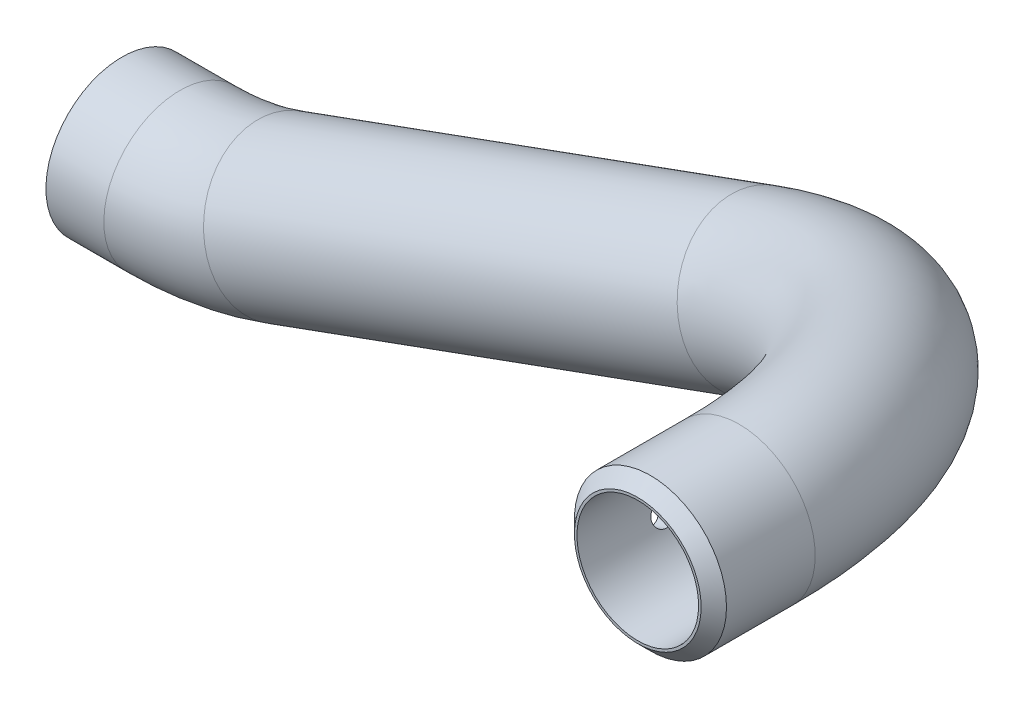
from build123d import *

# Parameters (mm, degrees)
ESQUISSE1_R             = 15
ESQUISSE1_R_2           = 12
CHANFREIN1_SIZE         = 2.5
ESQUISSE2_R             = 2.05
ENL_V_MAT_EXTRU_1_DEPTH = 212.985155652


with BuildPart() as part:
    # Balayage-Mince1: sweep along a curve in space
    with BuildLine() as balayage_mince1_path:
        Line((0, 0, 0), (11.420381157, 0, 0))
        ThreePointArc((11.420381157, 0, 0), (21.839271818, 0.911534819, 0), (31.941589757, 3.618442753, 0))
        Line((31.941589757, 3.618442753, 0), (125.366188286, 37.622215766, 0))
        ThreePointArc((125.366188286, 37.622215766, 0), (165.23396975, 52.132901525, 17.573593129), (181.747745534, 58.143424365, 60))
        Line((181.747745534, 58.143424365, 60), (181.747745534, 58.143424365, 80))
    # Esquisse1 → Balayage-Mince1 (sweep)
    with BuildSketch(Plane(origin=(0, 0, 0), x_dir=(0, 0, -1), z_dir=(1, 0, 0))):
        Circle(ESQUISSE1_R)
        Circle(ESQUISSE1_R_2, mode=Mode.SUBTRACT)
    sweep(path=balayage_mince1_path.line)

    # Chanfrein1
    chanfrein1_edges = [part.edges().sort_by_distance(p)[0] for p in [
        (167.652356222, 53.013122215, 80),
    ]]
    chamfer(chanfrein1_edges, length=CHANFREIN1_SIZE)

    # Esquisse2 → Enl_v. mat.-Extru.1 (cut, through all)
    with BuildSketch(Plane(origin=(179.174234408, 65.214088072, 0), x_dir=(0, 0, 1), z_dir=(-0.9396926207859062, -0.3420201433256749, 9.841653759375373e-15))):
        with Locations(Location((64, -7.524443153, 0), (0, 0, 90))):
            Circle(ESQUISSE2_R)
    extrude(amount=ENL_V_MAT_EXTRU_1_DEPTH, mode=Mode.SUBTRACT)


solid = part.part
